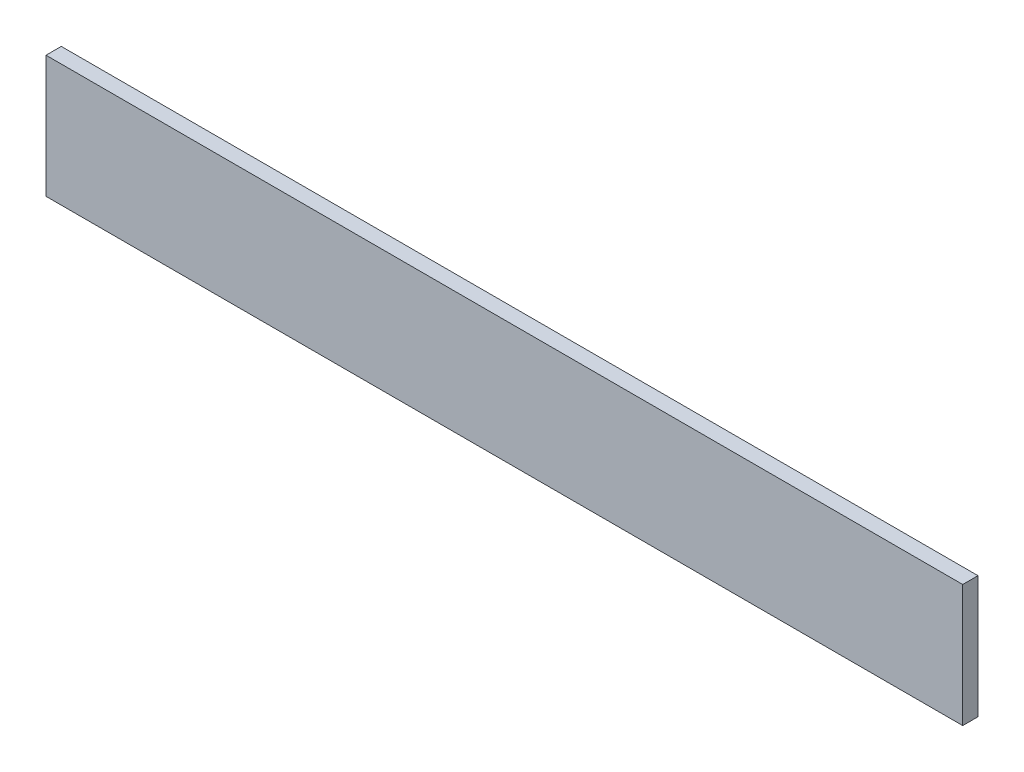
ISO-10303-21;
HEADER;
FILE_DESCRIPTION(('STEP AP214'),'2;1');
FILE_NAME('part.step','',(''),(''),'','','');
FILE_SCHEMA(('AUTOMOTIVE_DESIGN { 1 0 10303 214 1 1 1 1 }'));
ENDSEC;
DATA;
#1=APPLICATION_CONTEXT('core data for automotive mechanical design processes');
#2=APPLICATION_PROTOCOL_DEFINITION('international standard','automotive_design',2000,#1);
#3=PRODUCT_CONTEXT('',#1,'mechanical');
#4=PRODUCT('Part','Part','',(#3));
#5=PRODUCT_RELATED_PRODUCT_CATEGORY('part','',(#4));
#6=PRODUCT_DEFINITION_FORMATION('','',#4);
#7=PRODUCT_DEFINITION_CONTEXT('part definition',#1,'design');
#8=PRODUCT_DEFINITION('design','',#6,#7);
#9=PRODUCT_DEFINITION_SHAPE('','',#8);
#10=(LENGTH_UNIT() NAMED_UNIT(*) SI_UNIT(.MILLI.,.METRE.));
#11=(NAMED_UNIT(*) PLANE_ANGLE_UNIT() SI_UNIT($,.RADIAN.));
#12=(NAMED_UNIT(*) SI_UNIT($,.STERADIAN.) SOLID_ANGLE_UNIT());
#13=UNCERTAINTY_MEASURE_WITH_UNIT(LENGTH_MEASURE(1.E-05),#10,'distance_accuracy_value','');
#14=(GEOMETRIC_REPRESENTATION_CONTEXT(3) GLOBAL_UNCERTAINTY_ASSIGNED_CONTEXT((#13)) GLOBAL_UNIT_ASSIGNED_CONTEXT((#10,
#11,#12)) REPRESENTATION_CONTEXT('',''));
#15=CARTESIAN_POINT('',(0.,0.,0.));
#16=DIRECTION('',(0.,0.,1.));
#17=DIRECTION('',(1.,0.,0.));
#18=AXIS2_PLACEMENT_3D('',#15,#16,#17);
#19=CARTESIAN_POINT('',(-181.430128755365,71.0218884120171,12.7));
#20=DIRECTION('',(1.,0.,0.));
#21=DIRECTION('',(0.,1.,0.));
#22=AXIS2_PLACEMENT_3D('',#19,#20,#21);
#23=PLANE('',#22);
#24=DIRECTION('',(0.,-1.,0.));
#25=VECTOR('',#24,1.);
#26=CARTESIAN_POINT('',(-181.430128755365,71.0218884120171,0.));
#27=LINE('',#26,#25);
#28=CARTESIAN_POINT('',(-181.430128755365,71.0218884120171,0.));
#29=VERTEX_POINT('',#28);
#30=CARTESIAN_POINT('',(-181.430128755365,-30.5781115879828,0.));
#31=VERTEX_POINT('',#30);
#32=EDGE_CURVE('E75',#29,#31,#27,.T.);
#33=ORIENTED_EDGE('',*,*,#32,.T.);
#34=DIRECTION('',(0.,0.,-1.));
#35=VECTOR('',#34,1.);
#36=CARTESIAN_POINT('',(-181.430128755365,-30.5781115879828,12.7));
#37=LINE('',#36,#35);
#38=CARTESIAN_POINT('',(-181.430128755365,-30.5781115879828,12.7));
#39=VERTEX_POINT('',#38);
#40=EDGE_CURVE('E11',#39,#31,#37,.T.);
#41=ORIENTED_EDGE('',*,*,#40,.F.);
#42=DIRECTION('',(0.,-1.,0.));
#43=VECTOR('',#42,1.);
#44=CARTESIAN_POINT('',(-181.430128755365,71.0218884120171,12.7));
#45=LINE('',#44,#43);
#46=CARTESIAN_POINT('',(-181.430128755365,71.0218884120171,12.7));
#47=VERTEX_POINT('',#46);
#48=EDGE_CURVE('E93',#47,#39,#45,.T.);
#49=ORIENTED_EDGE('',*,*,#48,.F.);
#50=DIRECTION('',(0.,0.,-1.));
#51=VECTOR('',#50,1.);
#52=CARTESIAN_POINT('',(-181.430128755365,71.0218884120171,12.7));
#53=LINE('',#52,#51);
#54=EDGE_CURVE('E87',#47,#29,#53,.T.);
#55=ORIENTED_EDGE('',*,*,#54,.T.);
#56=EDGE_LOOP('',(#33,#41,#49,#55));
#57=FACE_BOUND('',#56,.T.);
#58=ADVANCED_FACE('F31',(#57),#23,.F.);
#59=CARTESIAN_POINT('',(-181.430128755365,-30.5781115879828,12.7));
#60=DIRECTION('',(0.,1.,0.));
#61=DIRECTION('',(0.,0.,1.));
#62=AXIS2_PLACEMENT_3D('',#59,#60,#61);
#63=PLANE('',#62);
#64=DIRECTION('',(1.,0.,0.));
#65=VECTOR('',#64,1.);
#66=CARTESIAN_POINT('',(-181.430128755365,-30.5781115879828,0.));
#67=LINE('',#66,#65);
#68=CARTESIAN_POINT('',(580.569871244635,-30.5781115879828,0.));
#69=VERTEX_POINT('',#68);
#70=EDGE_CURVE('E71',#31,#69,#67,.T.);
#71=ORIENTED_EDGE('',*,*,#70,.T.);
#72=DIRECTION('',(0.,0.,-1.));
#73=VECTOR('',#72,1.);
#74=CARTESIAN_POINT('',(580.569871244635,-30.5781115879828,12.7));
#75=LINE('',#74,#73);
#76=CARTESIAN_POINT('',(580.569871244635,-30.5781115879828,12.7));
#77=VERTEX_POINT('',#76);
#78=EDGE_CURVE('E38',#77,#69,#75,.T.);
#79=ORIENTED_EDGE('',*,*,#78,.F.);
#80=DIRECTION('',(1.,0.,0.));
#81=VECTOR('',#80,1.);
#82=CARTESIAN_POINT('',(-181.430128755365,-30.5781115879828,12.7));
#83=LINE('',#82,#81);
#84=EDGE_CURVE('E83',#39,#77,#83,.T.);
#85=ORIENTED_EDGE('',*,*,#84,.F.);
#86=ORIENTED_EDGE('',*,*,#40,.T.);
#87=EDGE_LOOP('',(#71,#79,#85,#86));
#88=FACE_BOUND('',#87,.T.);
#89=ADVANCED_FACE('F82',(#88),#63,.F.);
#90=CARTESIAN_POINT('',(580.569871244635,71.0218884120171,12.7));
#91=DIRECTION('',(-1.,0.,0.));
#92=DIRECTION('',(0.,0.,1.));
#93=AXIS2_PLACEMENT_3D('',#90,#91,#92);
#94=PLANE('',#93);
#95=DIRECTION('',(0.,1.,0.));
#96=VECTOR('',#95,1.);
#97=CARTESIAN_POINT('',(580.569871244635,71.0218884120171,0.));
#98=LINE('',#97,#96);
#99=CARTESIAN_POINT('',(580.569871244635,71.0218884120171,0.));
#100=VERTEX_POINT('',#99);
#101=EDGE_CURVE('E76',#69,#100,#98,.T.);
#102=ORIENTED_EDGE('',*,*,#101,.T.);
#103=DIRECTION('',(0.,0.,-1.));
#104=VECTOR('',#103,1.);
#105=CARTESIAN_POINT('',(580.569871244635,71.0218884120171,12.7));
#106=LINE('',#105,#104);
#107=CARTESIAN_POINT('',(580.569871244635,71.0218884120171,12.7));
#108=VERTEX_POINT('',#107);
#109=EDGE_CURVE('E99',#108,#100,#106,.T.);
#110=ORIENTED_EDGE('',*,*,#109,.F.);
#111=DIRECTION('',(0.,1.,0.));
#112=VECTOR('',#111,1.);
#113=CARTESIAN_POINT('',(580.569871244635,71.0218884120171,12.7));
#114=LINE('',#113,#112);
#115=EDGE_CURVE('E50',#77,#108,#114,.T.);
#116=ORIENTED_EDGE('',*,*,#115,.F.);
#117=ORIENTED_EDGE('',*,*,#78,.T.);
#118=EDGE_LOOP('',(#102,#110,#116,#117));
#119=FACE_BOUND('',#118,.T.);
#120=ADVANCED_FACE('F102',(#119),#94,.F.);
#121=CARTESIAN_POINT('',(-181.430128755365,71.0218884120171,12.7));
#122=DIRECTION('',(0.,-1.,0.));
#123=DIRECTION('',(0.,0.,-1.));
#124=AXIS2_PLACEMENT_3D('',#121,#122,#123);
#125=PLANE('',#124);
#126=DIRECTION('',(-1.,0.,0.));
#127=VECTOR('',#126,1.);
#128=CARTESIAN_POINT('',(-181.430128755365,71.0218884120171,0.));
#129=LINE('',#128,#127);
#130=EDGE_CURVE('E91',#100,#29,#129,.T.);
#131=ORIENTED_EDGE('',*,*,#130,.T.);
#132=ORIENTED_EDGE('',*,*,#54,.F.);
#133=DIRECTION('',(-1.,0.,0.));
#134=VECTOR('',#133,1.);
#135=CARTESIAN_POINT('',(-181.430128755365,71.0218884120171,12.7));
#136=LINE('',#135,#134);
#137=EDGE_CURVE('E45',#108,#47,#136,.T.);
#138=ORIENTED_EDGE('',*,*,#137,.F.);
#139=ORIENTED_EDGE('',*,*,#109,.T.);
#140=EDGE_LOOP('',(#131,#132,#138,#139));
#141=FACE_BOUND('',#140,.T.);
#142=ADVANCED_FACE('F104',(#141),#125,.F.);
#143=CARTESIAN_POINT('',(-181.430128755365,-30.5781115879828,12.7));
#144=DIRECTION('',(0.,0.,1.));
#145=DIRECTION('',(1.,0.,0.));
#146=AXIS2_PLACEMENT_3D('',#143,#144,#145);
#147=PLANE('',#146);
#148=ORIENTED_EDGE('',*,*,#48,.T.);
#149=ORIENTED_EDGE('',*,*,#84,.T.);
#150=ORIENTED_EDGE('',*,*,#115,.T.);
#151=ORIENTED_EDGE('',*,*,#137,.T.);
#152=EDGE_LOOP('',(#148,#149,#150,#151));
#153=FACE_BOUND('',#152,.T.);
#154=ADVANCED_FACE('F105',(#153),#147,.T.);
#155=CARTESIAN_POINT('',(-181.430128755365,-30.5781115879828,0.));
#156=DIRECTION('',(0.,0.,1.));
#157=DIRECTION('',(1.,0.,0.));
#158=AXIS2_PLACEMENT_3D('',#155,#156,#157);
#159=PLANE('',#158);
#160=ORIENTED_EDGE('',*,*,#32,.F.);
#161=ORIENTED_EDGE('',*,*,#130,.F.);
#162=ORIENTED_EDGE('',*,*,#101,.F.);
#163=ORIENTED_EDGE('',*,*,#70,.F.);
#164=EDGE_LOOP('',(#160,#161,#162,#163));
#165=FACE_BOUND('',#164,.T.);
#166=ADVANCED_FACE('F72',(#165),#159,.F.);
#167=CLOSED_SHELL('',(#58,#89,#120,#142,#154,#166));
#168=MANIFOLD_SOLID_BREP('B2',#167);
#169=ADVANCED_BREP_SHAPE_REPRESENTATION('',(#18,#168),#14);
#170=SHAPE_DEFINITION_REPRESENTATION(#9,#169);
ENDSEC;
END-ISO-10303-21;
